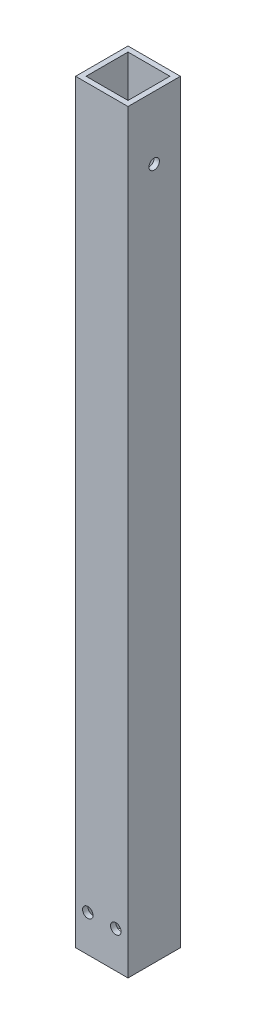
from build123d import *

# Parameters (mm, degrees)
SKETCH_1_W            = 15
SKETCH_1_H            = 15
SKETCH_1_W_2          = 12
SKETCH_1_H_2          = 12
EXTRUDE_1_DEPTH       = 241
CUT_EXTRUDE_2_REACH   = 243.583
SKETCH_3_R            = 1.5
CUT_EXTRUDE_3_REACH   = 243.583
SKETCH_4_R            = 1.5
CUT_EXTRUDE_4_REACH   = 243.583
SKETCH_5_R            = 3
SKETCH_8_W            = 15
SKETCH_8_H            = 25
CUT_EXTRUDE_7_DEPTH   = 242.58280154
HOLE_WIZARD_3_0_3_1_D = 3


with BuildPart() as part:
    # Sketch 1 → Extrude 1 (new body)
    with BuildSketch(Plane(origin=(0, 0, 0), x_dir=(1, 0, 0), z_dir=(0, 1, 0))):
        Rectangle(SKETCH_1_W, SKETCH_1_H)
        Rectangle(SKETCH_1_W_2, SKETCH_1_H_2, mode=Mode.SUBTRACT)
    extrude(amount=EXTRUDE_1_DEPTH)

    # Cut-Extrude 2: up to this face of the body (flat: up to its plane)
    cut_extrude_2_end = Plane(part.part.faces().sort_by_distance((-7.5, 120.5, 0))[0])
    # Sketch 3 → Cut-Extrude 2 (cut, up to the picked face)
    with BuildSketch(Plane(origin=(7.5, 0, 0), x_dir=(0, 0, -1), z_dir=(1, 0, 0)), mode=Mode.PRIVATE) as cut_extrude_2_sk1:
        with Locations((0, 223)):
            Circle(SKETCH_3_R)
    cut_extrude_2_tool1 = split(extrude(cut_extrude_2_sk1.sketch, amount=-CUT_EXTRUDE_2_REACH, mode=Mode.PRIVATE), bisect_by=cut_extrude_2_end, keep=Keep.BOTH, mode=Mode.PRIVATE)
    add(cut_extrude_2_tool1.solids().sort_by(Axis((7.5, 223, 0), (-1, 0, 0)))[0], mode=Mode.SUBTRACT)

    # Cut-Extrude 3: up to this face of the body (flat: up to its plane)
    cut_extrude_3_end = Plane(part.part.faces().sort_by_distance((0, 120.5, -7.5))[0])
    # Sketch 4 → Cut-Extrude 3 (cut, up to the picked face)
    with BuildSketch(Plane.XY.offset(7.5), mode=Mode.PRIVATE) as cut_extrude_3_sk1:
        with Locations((-2.5, 8)):
            Circle(SKETCH_4_R)
    cut_extrude_3_tool1 = split(extrude(cut_extrude_3_sk1.sketch, amount=-CUT_EXTRUDE_3_REACH, mode=Mode.PRIVATE), bisect_by=cut_extrude_3_end, keep=Keep.BOTH, mode=Mode.PRIVATE)
    add(cut_extrude_3_tool1.solids().sort_by(Axis((-2.5, 8, 7.5), (0, 0, -1)))[0], mode=Mode.SUBTRACT)

    # Cut-Extrude 4: up to this face of the body (flat: up to its plane)
    cut_extrude_4_end = Plane(part.part.faces().sort_by_distance((7.5, 120.299184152, 0))[0])
    # Sketch 5 → Cut-Extrude 4 (cut, up to the picked face)
    with BuildSketch(Plane.ZY.offset(7.5), mode=Mode.PRIVATE) as cut_extrude_4_sk1:
        with Locations((0, 15)):
            Circle(SKETCH_5_R)
    cut_extrude_4_tool1 = split(extrude(cut_extrude_4_sk1.sketch, amount=-CUT_EXTRUDE_4_REACH, mode=Mode.PRIVATE), bisect_by=cut_extrude_4_end, keep=Keep.BOTH, mode=Mode.PRIVATE)
    add(cut_extrude_4_tool1.solids().sort_by(Axis((-7.5, 15, 0), (1, 0, 0)))[0], mode=Mode.SUBTRACT)

    # Sketch 8 → Cut-Extrude 7 (cut, through all)
    with BuildSketch(Plane.ZY.offset(7.5)):
        with Locations((0, 12.5)):
            Rectangle(SKETCH_8_W, SKETCH_8_H)
    extrude(amount=-CUT_EXTRUDE_7_DEPTH, mode=Mode.SUBTRACT)

    # Hole Wizard 3.0 _3_ _1 (through all)
    with Locations(Plane.XY.offset(7.5)):
        with Locations((4, 35.5), (-4, 35.5)):
            Hole(HOLE_WIZARD_3_0_3_1_D / 2)


solid = part.part
